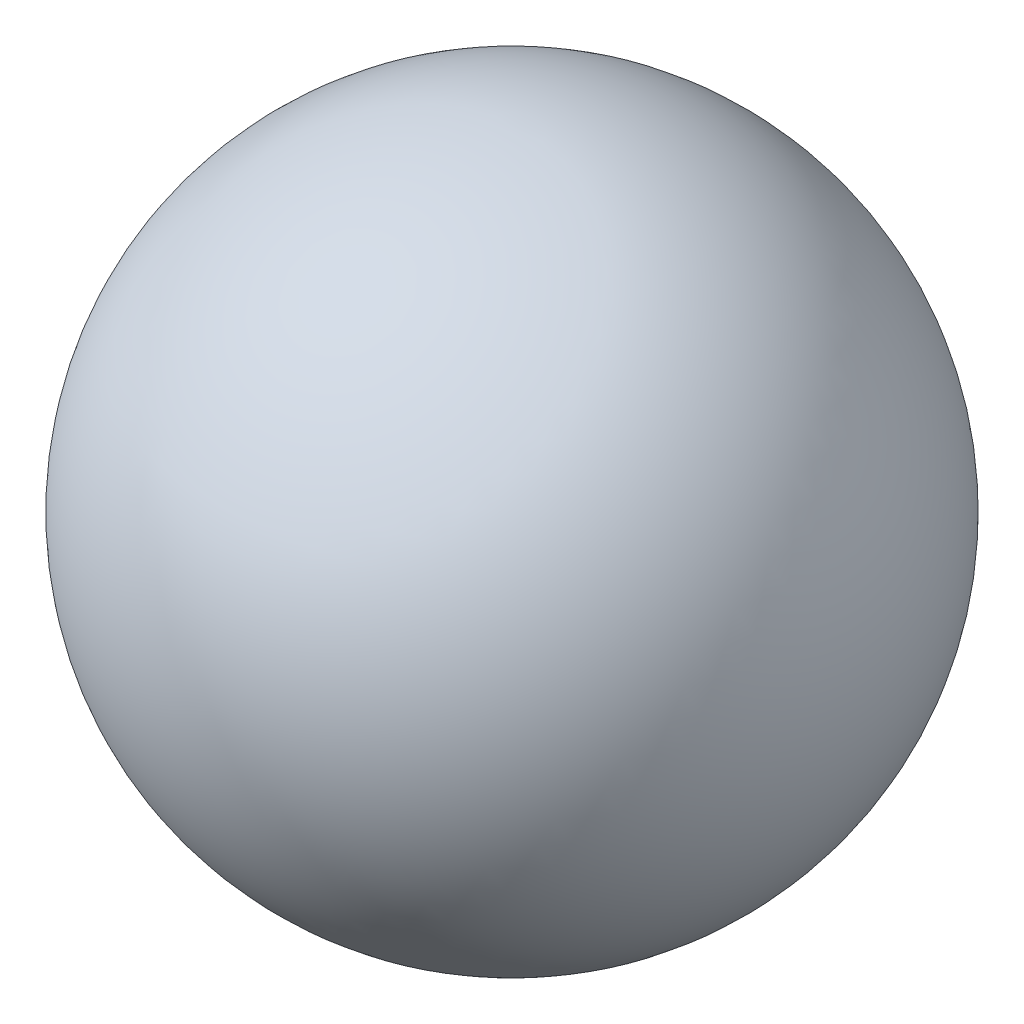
from build123d import *


with BuildPart() as part:
    # Sketch1 → Revolve1 (revolve)
    with BuildSketch(Plane.XY):
        with BuildLine():
            Line((0, -6.39), (0, 6.39))
            ThreePointArc((0, 6.39), (6.39, 0), (0, -6.39))
        make_face()
    revolve(axis=Axis((0, -6.39, 0), (0, 1, 0)))


solid = part.part
